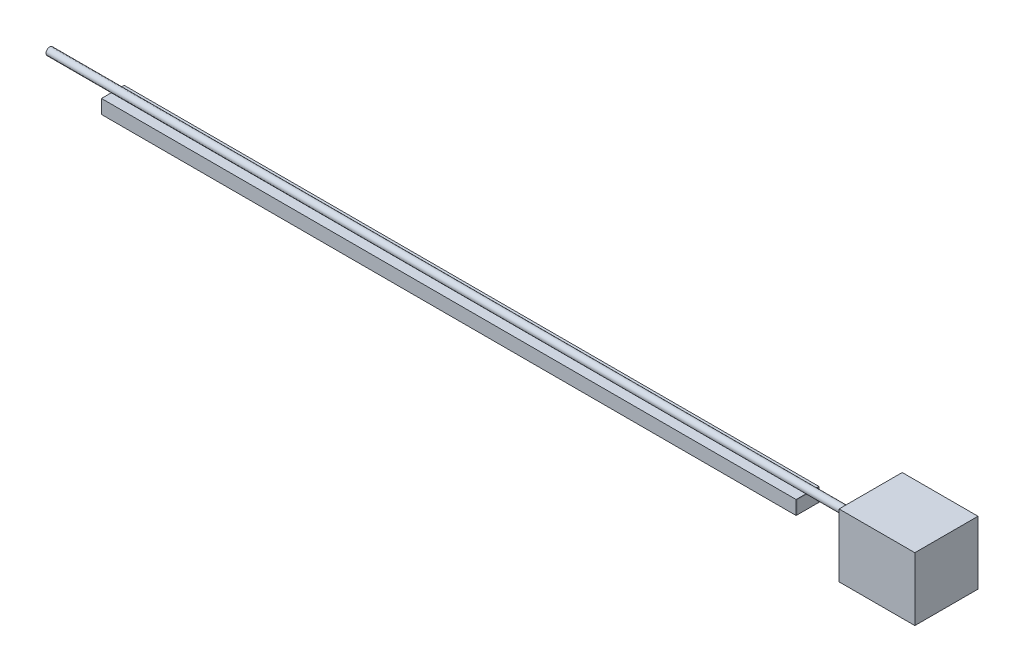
ISO-10303-21;
HEADER;
FILE_DESCRIPTION(('STEP AP214'),'2;1');
FILE_NAME('part.step','',(''),(''),'','','');
FILE_SCHEMA(('AUTOMOTIVE_DESIGN { 1 0 10303 214 1 1 1 1 }'));
ENDSEC;
DATA;
#1=APPLICATION_CONTEXT('core data for automotive mechanical design processes');
#2=APPLICATION_PROTOCOL_DEFINITION('international standard','automotive_design',2000,#1);
#3=PRODUCT_CONTEXT('',#1,'mechanical');
#4=PRODUCT('Part','Part','',(#3));
#5=PRODUCT_RELATED_PRODUCT_CATEGORY('part','',(#4));
#6=PRODUCT_DEFINITION_FORMATION('','',#4);
#7=PRODUCT_DEFINITION_CONTEXT('part definition',#1,'design');
#8=PRODUCT_DEFINITION('design','',#6,#7);
#9=PRODUCT_DEFINITION_SHAPE('','',#8);
#10=(LENGTH_UNIT() NAMED_UNIT(*) SI_UNIT(.MILLI.,.METRE.));
#11=(NAMED_UNIT(*) PLANE_ANGLE_UNIT() SI_UNIT($,.RADIAN.));
#12=(NAMED_UNIT(*) SI_UNIT($,.STERADIAN.) SOLID_ANGLE_UNIT());
#13=UNCERTAINTY_MEASURE_WITH_UNIT(LENGTH_MEASURE(1.E-05),#10,'distance_accuracy_value','');
#14=(GEOMETRIC_REPRESENTATION_CONTEXT(3) GLOBAL_UNCERTAINTY_ASSIGNED_CONTEXT((#13)) GLOBAL_UNIT_ASSIGNED_CONTEXT((#10,
#11,#12)) REPRESENTATION_CONTEXT('',''));
#15=CARTESIAN_POINT('',(0.,0.,0.));
#16=DIRECTION('',(0.,0.,1.));
#17=DIRECTION('',(1.,0.,0.));
#18=AXIS2_PLACEMENT_3D('',#15,#16,#17);
#19=CARTESIAN_POINT('',(548.,-11.,17.));
#20=DIRECTION('',(0.,-1.,0.));
#21=DIRECTION('',(0.,0.,-1.));
#22=AXIS2_PLACEMENT_3D('',#19,#20,#21);
#23=PLANE('',#22);
#24=DIRECTION('',(0.,0.,-1.));
#25=VECTOR('',#24,1.);
#26=CARTESIAN_POINT('',(550.,-11.,17.));
#27=LINE('',#26,#25);
#28=CARTESIAN_POINT('',(550.,-11.,17.));
#29=VERTEX_POINT('',#28);
#30=CARTESIAN_POINT('',(550.,-11.,-17.));
#31=VERTEX_POINT('',#30);
#32=EDGE_CURVE('P0_E81',#29,#31,#27,.T.);
#33=ORIENTED_EDGE('',*,*,#32,.F.);
#34=DIRECTION('',(1.,0.,0.));
#35=VECTOR('',#34,1.);
#36=CARTESIAN_POINT('',(548.,-11.,17.));
#37=LINE('',#36,#35);
#38=CARTESIAN_POINT('',(548.,-11.,17.));
#39=VERTEX_POINT('',#38);
#40=EDGE_CURVE('P0_E11',#39,#29,#37,.T.);
#41=ORIENTED_EDGE('',*,*,#40,.F.);
#42=DIRECTION('',(0.,0.,-1.));
#43=VECTOR('',#42,1.);
#44=CARTESIAN_POINT('',(548.,-11.,17.));
#45=LINE('',#44,#43);
#46=CARTESIAN_POINT('',(548.,-11.,-17.));
#47=VERTEX_POINT('',#46);
#48=EDGE_CURVE('P0_E75',#39,#47,#45,.T.);
#49=ORIENTED_EDGE('',*,*,#48,.T.);
#50=DIRECTION('',(1.,0.,0.));
#51=VECTOR('',#50,1.);
#52=CARTESIAN_POINT('',(548.,-11.,-17.));
#53=LINE('',#52,#51);
#54=EDGE_CURVE('P0_E20',#47,#31,#53,.T.);
#55=ORIENTED_EDGE('',*,*,#54,.T.);
#56=EDGE_LOOP('',(#33,#41,#49,#55));
#57=FACE_BOUND('',#56,.T.);
#58=ADVANCED_FACE('P0_F17',(#57),#23,.T.);
#59=CARTESIAN_POINT('',(548.,-11.,17.));
#60=DIRECTION('',(0.,0.,1.));
#61=DIRECTION('',(1.,0.,0.));
#62=AXIS2_PLACEMENT_3D('',#59,#60,#61);
#63=PLANE('',#62);
#64=DIRECTION('',(0.,-1.,0.));
#65=VECTOR('',#64,1.);
#66=CARTESIAN_POINT('',(550.,-11.,17.));
#67=LINE('',#66,#65);
#68=CARTESIAN_POINT('',(550.,10.,17.));
#69=VERTEX_POINT('',#68);
#70=EDGE_CURVE('P0_E77',#69,#29,#67,.T.);
#71=ORIENTED_EDGE('',*,*,#70,.F.);
#72=DIRECTION('',(1.,0.,0.));
#73=VECTOR('',#72,1.);
#74=CARTESIAN_POINT('',(548.,10.,17.));
#75=LINE('',#74,#73);
#76=CARTESIAN_POINT('',(548.,10.,17.));
#77=VERTEX_POINT('',#76);
#78=EDGE_CURVE('P0_E26',#77,#69,#75,.T.);
#79=ORIENTED_EDGE('',*,*,#78,.F.);
#80=DIRECTION('',(0.,-1.,0.));
#81=VECTOR('',#80,1.);
#82=CARTESIAN_POINT('',(548.,-11.,17.));
#83=LINE('',#82,#81);
#84=EDGE_CURVE('P0_E72',#77,#39,#83,.T.);
#85=ORIENTED_EDGE('',*,*,#84,.T.);
#86=ORIENTED_EDGE('',*,*,#40,.T.);
#87=EDGE_LOOP('',(#71,#79,#85,#86));
#88=FACE_BOUND('',#87,.T.);
#89=ADVANCED_FACE('P0_F91',(#88),#63,.T.);
#90=CARTESIAN_POINT('',(548.,10.,17.));
#91=DIRECTION('',(0.,1.,0.));
#92=DIRECTION('',(0.,0.,1.));
#93=AXIS2_PLACEMENT_3D('',#90,#91,#92);
#94=PLANE('',#93);
#95=DIRECTION('',(0.,0.,1.));
#96=VECTOR('',#95,1.);
#97=CARTESIAN_POINT('',(550.,10.,17.));
#98=LINE('',#97,#96);
#99=CARTESIAN_POINT('',(550.,10.,-17.));
#100=VERTEX_POINT('',#99);
#101=EDGE_CURVE('P0_E67',#100,#69,#98,.T.);
#102=ORIENTED_EDGE('',*,*,#101,.F.);
#103=DIRECTION('',(1.,0.,0.));
#104=VECTOR('',#103,1.);
#105=CARTESIAN_POINT('',(548.,10.,-17.));
#106=LINE('',#105,#104);
#107=CARTESIAN_POINT('',(548.,10.,-17.));
#108=VERTEX_POINT('',#107);
#109=EDGE_CURVE('P0_E62',#108,#100,#106,.T.);
#110=ORIENTED_EDGE('',*,*,#109,.F.);
#111=DIRECTION('',(0.,0.,1.));
#112=VECTOR('',#111,1.);
#113=CARTESIAN_POINT('',(548.,10.,17.));
#114=LINE('',#113,#112);
#115=EDGE_CURVE('P0_E65',#108,#77,#114,.T.);
#116=ORIENTED_EDGE('',*,*,#115,.T.);
#117=ORIENTED_EDGE('',*,*,#78,.T.);
#118=EDGE_LOOP('',(#102,#110,#116,#117));
#119=FACE_BOUND('',#118,.T.);
#120=ADVANCED_FACE('P0_F64',(#119),#94,.T.);
#121=CARTESIAN_POINT('',(548.,10.,-17.));
#122=DIRECTION('',(0.,0.,-1.));
#123=DIRECTION('',(-1.,0.,0.));
#124=AXIS2_PLACEMENT_3D('',#121,#122,#123);
#125=PLANE('',#124);
#126=DIRECTION('',(0.,1.,0.));
#127=VECTOR('',#126,1.);
#128=CARTESIAN_POINT('',(550.,10.,-17.));
#129=LINE('',#128,#127);
#130=EDGE_CURVE('P0_E84',#31,#100,#129,.T.);
#131=ORIENTED_EDGE('',*,*,#130,.F.);
#132=ORIENTED_EDGE('',*,*,#54,.F.);
#133=DIRECTION('',(0.,1.,0.));
#134=VECTOR('',#133,1.);
#135=CARTESIAN_POINT('',(548.,10.,-17.));
#136=LINE('',#135,#134);
#137=EDGE_CURVE('P0_E71',#47,#108,#136,.T.);
#138=ORIENTED_EDGE('',*,*,#137,.T.);
#139=ORIENTED_EDGE('',*,*,#109,.T.);
#140=EDGE_LOOP('',(#131,#132,#138,#139));
#141=FACE_BOUND('',#140,.T.);
#142=ADVANCED_FACE('P0_F74',(#141),#125,.T.);
#143=CARTESIAN_POINT('',(548.,0.,0.));
#144=DIRECTION('',(-1.,0.,0.));
#145=DIRECTION('',(0.,0.,1.));
#146=AXIS2_PLACEMENT_3D('',#143,#144,#145);
#147=PLANE('',#146);
#148=ORIENTED_EDGE('',*,*,#48,.F.);
#149=ORIENTED_EDGE('',*,*,#84,.F.);
#150=ORIENTED_EDGE('',*,*,#115,.F.);
#151=ORIENTED_EDGE('',*,*,#137,.F.);
#152=EDGE_LOOP('',(#148,#149,#150,#151));
#153=FACE_BOUND('',#152,.T.);
#154=ADVANCED_FACE('P0_F70',(#153),#147,.T.);
#155=CARTESIAN_POINT('',(550.,0.,0.));
#156=DIRECTION('',(-1.,0.,0.));
#157=DIRECTION('',(0.,0.,1.));
#158=AXIS2_PLACEMENT_3D('',#155,#156,#157);
#159=PLANE('',#158);
#160=ORIENTED_EDGE('',*,*,#32,.T.);
#161=ORIENTED_EDGE('',*,*,#130,.T.);
#162=ORIENTED_EDGE('',*,*,#101,.T.);
#163=ORIENTED_EDGE('',*,*,#70,.T.);
#164=EDGE_LOOP('',(#160,#161,#162,#163));
#165=FACE_BOUND('',#164,.T.);
#166=ADVANCED_FACE('P0_F90',(#165),#159,.F.);
#167=CLOSED_SHELL('',(#58,#89,#120,#142,#154,#166));
#168=MANIFOLD_SOLID_BREP('P0_B1',#167);
#169=CARTESIAN_POINT('',(650.,16.85,0.));
#170=DIRECTION('',(-1.,0.,0.));
#171=DIRECTION('',(0.,0.,1.));
#172=AXIS2_PLACEMENT_3D('',#169,#170,#171);
#173=CYLINDRICAL_SURFACE('',#172,5.85);
#174=CARTESIAN_POINT('',(-650.,16.85,0.));
#175=DIRECTION('',(1.,0.,0.));
#176=DIRECTION('',(0.,0.,-1.));
#177=AXIS2_PLACEMENT_3D('',#174,#175,#176);
#178=CIRCLE('',#177,5.85);
#179=CARTESIAN_POINT('',(-650.,16.85,-5.85000000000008));
#180=VERTEX_POINT('',#179);
#181=EDGE_CURVE('P1_E10',#180,#180,#178,.T.);
#182=ORIENTED_EDGE('',*,*,#181,.T.);
#183=EDGE_LOOP('',(#182));
#184=FACE_BOUND('',#183,.T.);
#185=CARTESIAN_POINT('',(750.,16.85,0.));
#186=DIRECTION('',(1.,0.,0.));
#187=DIRECTION('',(0.,0.,-1.));
#188=AXIS2_PLACEMENT_3D('',#185,#186,#187);
#189=CIRCLE('',#188,5.85);
#190=CARTESIAN_POINT('',(750.,16.85,-5.84999999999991));
#191=VERTEX_POINT('',#190);
#192=EDGE_CURVE('P1_E21',#191,#191,#189,.T.);
#193=ORIENTED_EDGE('',*,*,#192,.F.);
#194=EDGE_LOOP('',(#193));
#195=FACE_BOUND('',#194,.T.);
#196=ADVANCED_FACE('P1_F15',(#184,#195),#173,.T.);
#197=CARTESIAN_POINT('',(-650.,16.85,0.));
#198=DIRECTION('',(1.,0.,0.));
#199=DIRECTION('',(0.,0.,-1.));
#200=AXIS2_PLACEMENT_3D('',#197,#198,#199);
#201=PLANE('',#200);
#202=ORIENTED_EDGE('',*,*,#181,.F.);
#203=EDGE_LOOP('',(#202));
#204=FACE_BOUND('',#203,.T.);
#205=ADVANCED_FACE('P1_F30',(#204),#201,.F.);
#206=CARTESIAN_POINT('',(750.,16.85,0.));
#207=DIRECTION('',(1.,0.,0.));
#208=DIRECTION('',(0.,0.,-1.));
#209=AXIS2_PLACEMENT_3D('',#206,#207,#208);
#210=PLANE('',#209);
#211=ORIENTED_EDGE('',*,*,#192,.T.);
#212=EDGE_LOOP('',(#211));
#213=FACE_BOUND('',#212,.T.);
#214=ADVANCED_FACE('P1_F27',(#213),#210,.T.);
#215=CLOSED_SHELL('',(#196,#205,#214));
#216=MANIFOLD_SOLID_BREP('P1_B1',#215);
#217=CARTESIAN_POINT('',(549.,-11.,17.));
#218=CARTESIAN_POINT('',(549.,-12.8039677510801,4.93992907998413));
#219=CARTESIAN_POINT('',(549.,-11.8868294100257,-5.59201097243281));
#220=CARTESIAN_POINT('',(549.,-11.,-17.));
#221=B_SPLINE_CURVE_WITH_KNOTS('',3,(#217,#218,#219,#220),.UNSPECIFIED.,.F.,.F.,(4,4),(0.,1.),.UNSPECIFIED.);
#222=DIRECTION('',(-1.,0.,0.));
#223=VECTOR('',#222,1.);
#224=SURFACE_OF_LINEAR_EXTRUSION('',#221,#223);
#225=CARTESIAN_POINT('',(-549.,-11.,17.));
#226=CARTESIAN_POINT('',(-549.,-12.8039677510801,4.93992907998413));
#227=CARTESIAN_POINT('',(-549.,-11.8868294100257,-5.59201097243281));
#228=CARTESIAN_POINT('',(-549.,-11.,-17.));
#229=B_SPLINE_CURVE_WITH_KNOTS('',3,(#225,#226,#227,#228),.UNSPECIFIED.,.F.,.F.,(4,4),(0.,1.),.UNSPECIFIED.);
#230=CARTESIAN_POINT('',(-549.,-11.,17.));
#231=VERTEX_POINT('',#230);
#232=CARTESIAN_POINT('',(-549.,-11.,-17.));
#233=VERTEX_POINT('',#232);
#234=EDGE_CURVE('P2_E114',#231,#233,#229,.T.);
#235=ORIENTED_EDGE('',*,*,#234,.T.);
#236=DIRECTION('',(-1.,0.,0.));
#237=VECTOR('',#236,1.);
#238=CARTESIAN_POINT('',(549.,-11.,-17.));
#239=LINE('',#238,#237);
#240=CARTESIAN_POINT('',(549.,-11.,-17.));
#241=VERTEX_POINT('',#240);
#242=EDGE_CURVE('P2_E11',#241,#233,#239,.T.);
#243=ORIENTED_EDGE('',*,*,#242,.F.);
#244=CARTESIAN_POINT('',(549.,-11.,17.));
#245=VERTEX_POINT('',#244);
#246=EDGE_CURVE('P2_E138',#245,#241,#221,.T.);
#247=ORIENTED_EDGE('',*,*,#246,.F.);
#248=DIRECTION('',(-1.,0.,0.));
#249=VECTOR('',#248,1.);
#250=CARTESIAN_POINT('',(549.,-11.,17.));
#251=LINE('',#250,#249);
#252=EDGE_CURVE('P2_E110',#245,#231,#251,.T.);
#253=ORIENTED_EDGE('',*,*,#252,.T.);
#254=EDGE_LOOP('',(#235,#243,#247,#253));
#255=FACE_BOUND('',#254,.T.);
#256=ADVANCED_FACE('P2_F17',(#255),#224,.F.);
#257=CARTESIAN_POINT('',(549.,-11.,-17.));
#258=DIRECTION('',(0.,0.,1.));
#259=DIRECTION('',(1.,0.,0.));
#260=AXIS2_PLACEMENT_3D('',#257,#258,#259);
#261=PLANE('',#260);
#262=DIRECTION('',(0.,1.,0.));
#263=VECTOR('',#262,1.);
#264=CARTESIAN_POINT('',(-549.,-11.,-17.));
#265=LINE('',#264,#263);
#266=CARTESIAN_POINT('',(-549.,-6.,-17.));
#267=VERTEX_POINT('',#266);
#268=EDGE_CURVE('P2_E119',#233,#267,#265,.T.);
#269=ORIENTED_EDGE('',*,*,#268,.T.);
#270=DIRECTION('',(-1.,0.,0.));
#271=VECTOR('',#270,1.);
#272=CARTESIAN_POINT('',(549.,-6.,-17.));
#273=LINE('',#272,#271);
#274=CARTESIAN_POINT('',(549.,-6.,-17.));
#275=VERTEX_POINT('',#274);
#276=EDGE_CURVE('P2_E26',#275,#267,#273,.T.);
#277=ORIENTED_EDGE('',*,*,#276,.F.);
#278=DIRECTION('',(0.,1.,0.));
#279=VECTOR('',#278,1.);
#280=CARTESIAN_POINT('',(549.,-11.,-17.));
#281=LINE('',#280,#279);
#282=EDGE_CURVE('P2_E77',#241,#275,#281,.T.);
#283=ORIENTED_EDGE('',*,*,#282,.F.);
#284=ORIENTED_EDGE('',*,*,#242,.T.);
#285=EDGE_LOOP('',(#269,#277,#283,#284));
#286=FACE_BOUND('',#285,.T.);
#287=ADVANCED_FACE('P2_F182',(#286),#261,.F.);
#288=CARTESIAN_POINT('',(549.,-6.,-16.));
#289=DIRECTION('',(0.,-1.,0.));
#290=DIRECTION('',(0.,0.,-1.));
#291=AXIS2_PLACEMENT_3D('',#288,#289,#290);
#292=PLANE('',#291);
#293=DIRECTION('',(0.,0.,1.));
#294=VECTOR('',#293,1.);
#295=CARTESIAN_POINT('',(-549.,-6.,-16.));
#296=LINE('',#295,#294);
#297=CARTESIAN_POINT('',(-549.,-6.,-16.));
#298=VERTEX_POINT('',#297);
#299=EDGE_CURVE('P2_E124',#267,#298,#296,.T.);
#300=ORIENTED_EDGE('',*,*,#299,.T.);
#301=DIRECTION('',(-1.,0.,0.));
#302=VECTOR('',#301,1.);
#303=CARTESIAN_POINT('',(549.,-6.,-16.));
#304=LINE('',#303,#302);
#305=CARTESIAN_POINT('',(549.,-6.,-16.));
#306=VERTEX_POINT('',#305);
#307=EDGE_CURVE('P2_E145',#306,#298,#304,.T.);
#308=ORIENTED_EDGE('',*,*,#307,.F.);
#309=DIRECTION('',(0.,0.,1.));
#310=VECTOR('',#309,1.);
#311=CARTESIAN_POINT('',(549.,-6.,-16.));
#312=LINE('',#311,#310);
#313=EDGE_CURVE('P2_E153',#275,#306,#312,.T.);
#314=ORIENTED_EDGE('',*,*,#313,.F.);
#315=ORIENTED_EDGE('',*,*,#276,.T.);
#316=EDGE_LOOP('',(#300,#308,#314,#315));
#317=FACE_BOUND('',#316,.T.);
#318=ADVANCED_FACE('P2_F151',(#317),#292,.F.);
#319=CARTESIAN_POINT('',(549.,-10.0748780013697,-16.));
#320=DIRECTION('',(0.,0.,-1.));
#321=DIRECTION('',(0.,1.,0.));
#322=AXIS2_PLACEMENT_3D('',#319,#320,#321);
#323=PLANE('',#322);
#324=DIRECTION('',(0.,-1.,0.));
#325=VECTOR('',#324,1.);
#326=CARTESIAN_POINT('',(-549.,-10.0748780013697,-16.));
#327=LINE('',#326,#325);
#328=CARTESIAN_POINT('',(-549.,-10.0748780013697,-16.));
#329=VERTEX_POINT('',#328);
#330=EDGE_CURVE('P2_E126',#298,#329,#327,.T.);
#331=ORIENTED_EDGE('',*,*,#330,.T.);
#332=DIRECTION('',(-1.,0.,0.));
#333=VECTOR('',#332,1.);
#334=CARTESIAN_POINT('',(549.,-10.0748780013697,-16.));
#335=LINE('',#334,#333);
#336=CARTESIAN_POINT('',(549.,-10.0748780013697,-16.));
#337=VERTEX_POINT('',#336);
#338=EDGE_CURVE('P2_E142',#337,#329,#335,.T.);
#339=ORIENTED_EDGE('',*,*,#338,.F.);
#340=DIRECTION('',(0.,-1.,0.));
#341=VECTOR('',#340,1.);
#342=CARTESIAN_POINT('',(549.,-10.0748780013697,-16.));
#343=LINE('',#342,#341);
#344=EDGE_CURVE('P2_E165',#306,#337,#343,.T.);
#345=ORIENTED_EDGE('',*,*,#344,.F.);
#346=ORIENTED_EDGE('',*,*,#307,.T.);
#347=EDGE_LOOP('',(#331,#339,#345,#346));
#348=FACE_BOUND('',#347,.T.);
#349=ADVANCED_FACE('P2_F161',(#348),#323,.F.);
#350=CARTESIAN_POINT('',(549.,-10.0748780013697,-16.));
#351=CARTESIAN_POINT('',(549.,-10.1791678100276,-14.6632383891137));
#352=CARTESIAN_POINT('',(549.,-10.3893876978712,-11.9755906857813));
#353=CARTESIAN_POINT('',(549.,-10.7642021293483,-6.71077190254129));
#354=CARTESIAN_POINT('',(549.,-11.0216241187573,-1.49019693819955));
#355=CARTESIAN_POINT('',(549.,-11.0520527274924,3.76870554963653));
#356=CARTESIAN_POINT('',(549.,-10.934802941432,7.75866460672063));
#357=CARTESIAN_POINT('',(549.,-10.6973581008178,11.1455915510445));
#358=CARTESIAN_POINT('',(549.,-10.4110622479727,13.8975776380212));
#359=CARTESIAN_POINT('',(549.,-10.2317243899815,15.3027193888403));
#360=CARTESIAN_POINT('',(549.,-10.1342698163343,16.));
#361=B_SPLINE_CURVE_WITH_KNOTS('',3,(#350,#351,#352,#353,#354,#355,#356,#357,#358,#359,#360),
.UNSPECIFIED.,.F.,.F.,(4,1,1,1,1,1,1,1,4),(0.0238849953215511,0.14252422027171,
0.261163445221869,0.498441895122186,0.617081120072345,0.735720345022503,0.854359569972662,
0.913679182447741,0.972998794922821),.UNSPECIFIED.);
#362=DIRECTION('',(-1.,0.,0.));
#363=VECTOR('',#362,1.);
#364=SURFACE_OF_LINEAR_EXTRUSION('',#361,#363);
#365=CARTESIAN_POINT('',(-549.,-10.0748780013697,-16.));
#366=CARTESIAN_POINT('',(-549.,-10.1791678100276,-14.6632383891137));
#367=CARTESIAN_POINT('',(-549.,-10.3893876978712,-11.9755906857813));
#368=CARTESIAN_POINT('',(-549.,-10.7642021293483,-6.71077190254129));
#369=CARTESIAN_POINT('',(-549.,-11.0216241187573,-1.49019693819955));
#370=CARTESIAN_POINT('',(-549.,-11.0520527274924,3.76870554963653));
#371=CARTESIAN_POINT('',(-549.,-10.934802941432,7.75866460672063));
#372=CARTESIAN_POINT('',(-549.,-10.6973581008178,11.1455915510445));
#373=CARTESIAN_POINT('',(-549.,-10.4110622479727,13.8975776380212));
#374=CARTESIAN_POINT('',(-549.,-10.2317243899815,15.3027193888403));
#375=CARTESIAN_POINT('',(-549.,-10.1342698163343,16.));
#376=B_SPLINE_CURVE_WITH_KNOTS('',3,(#365,#366,#367,#368,#369,#370,#371,#372,#373,#374,#375),
.UNSPECIFIED.,.F.,.F.,(4,1,1,1,1,1,1,1,4),(0.0238849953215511,0.14252422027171,
0.261163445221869,0.498441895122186,0.617081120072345,0.735720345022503,0.854359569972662,
0.913679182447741,0.972998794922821),.UNSPECIFIED.);
#377=CARTESIAN_POINT('',(-549.,-10.1342698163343,16.));
#378=VERTEX_POINT('',#377);
#379=EDGE_CURVE('P2_E128',#329,#378,#376,.T.);
#380=ORIENTED_EDGE('',*,*,#379,.T.);
#381=DIRECTION('',(-1.,0.,0.));
#382=VECTOR('',#381,1.);
#383=CARTESIAN_POINT('',(549.,-10.1342698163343,16.));
#384=LINE('',#383,#382);
#385=CARTESIAN_POINT('',(549.,-10.1342698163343,16.));
#386=VERTEX_POINT('',#385);
#387=EDGE_CURVE('P2_E105',#386,#378,#384,.T.);
#388=ORIENTED_EDGE('',*,*,#387,.F.);
#389=EDGE_CURVE('P2_E96',#337,#386,#361,.T.);
#390=ORIENTED_EDGE('',*,*,#389,.F.);
#391=ORIENTED_EDGE('',*,*,#338,.T.);
#392=EDGE_LOOP('',(#380,#388,#390,#391));
#393=FACE_BOUND('',#392,.T.);
#394=ADVANCED_FACE('P2_F164',(#393),#364,.F.);
#395=CARTESIAN_POINT('',(549.,-10.1342698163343,16.));
#396=DIRECTION('',(0.,0.,1.));
#397=DIRECTION('',(1.,0.,0.));
#398=AXIS2_PLACEMENT_3D('',#395,#396,#397);
#399=PLANE('',#398);
#400=DIRECTION('',(0.,1.,0.));
#401=VECTOR('',#400,1.);
#402=CARTESIAN_POINT('',(-549.,-10.1342698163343,16.));
#403=LINE('',#402,#401);
#404=CARTESIAN_POINT('',(-549.,-6.,16.));
#405=VERTEX_POINT('',#404);
#406=EDGE_CURVE('P2_E104',#378,#405,#403,.T.);
#407=ORIENTED_EDGE('',*,*,#406,.T.);
#408=DIRECTION('',(-1.,0.,0.));
#409=VECTOR('',#408,1.);
#410=CARTESIAN_POINT('',(549.,-6.,16.));
#411=LINE('',#410,#409);
#412=CARTESIAN_POINT('',(549.,-6.,16.));
#413=VERTEX_POINT('',#412);
#414=EDGE_CURVE('P2_E101',#413,#405,#411,.T.);
#415=ORIENTED_EDGE('',*,*,#414,.F.);
#416=DIRECTION('',(0.,1.,0.));
#417=VECTOR('',#416,1.);
#418=CARTESIAN_POINT('',(549.,-10.1342698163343,16.));
#419=LINE('',#418,#417);
#420=EDGE_CURVE('P2_E90',#386,#413,#419,.T.);
#421=ORIENTED_EDGE('',*,*,#420,.F.);
#422=ORIENTED_EDGE('',*,*,#387,.T.);
#423=EDGE_LOOP('',(#407,#415,#421,#422));
#424=FACE_BOUND('',#423,.T.);
#425=ADVANCED_FACE('P2_F102',(#424),#399,.F.);
#426=CARTESIAN_POINT('',(549.,-6.,17.));
#427=DIRECTION('',(0.,-1.,0.));
#428=DIRECTION('',(0.,0.,-1.));
#429=AXIS2_PLACEMENT_3D('',#426,#427,#428);
#430=PLANE('',#429);
#431=DIRECTION('',(0.,0.,1.));
#432=VECTOR('',#431,1.);
#433=CARTESIAN_POINT('',(-549.,-6.,17.));
#434=LINE('',#433,#432);
#435=CARTESIAN_POINT('',(-549.,-6.,17.));
#436=VERTEX_POINT('',#435);
#437=EDGE_CURVE('P2_E63',#405,#436,#434,.T.);
#438=ORIENTED_EDGE('',*,*,#437,.T.);
#439=DIRECTION('',(-1.,0.,0.));
#440=VECTOR('',#439,1.);
#441=CARTESIAN_POINT('',(549.,-6.,17.));
#442=LINE('',#441,#440);
#443=CARTESIAN_POINT('',(549.,-6.,17.));
#444=VERTEX_POINT('',#443);
#445=EDGE_CURVE('P2_E106',#444,#436,#442,.T.);
#446=ORIENTED_EDGE('',*,*,#445,.F.);
#447=DIRECTION('',(0.,0.,1.));
#448=VECTOR('',#447,1.);
#449=CARTESIAN_POINT('',(549.,-6.,17.));
#450=LINE('',#449,#448);
#451=EDGE_CURVE('P2_E94',#413,#444,#450,.T.);
#452=ORIENTED_EDGE('',*,*,#451,.F.);
#453=ORIENTED_EDGE('',*,*,#414,.T.);
#454=EDGE_LOOP('',(#438,#446,#452,#453));
#455=FACE_BOUND('',#454,.T.);
#456=ADVANCED_FACE('P2_F108',(#455),#430,.F.);
#457=CARTESIAN_POINT('',(549.,-11.,17.));
#458=DIRECTION('',(0.,0.,-1.));
#459=DIRECTION('',(-1.,0.,0.));
#460=AXIS2_PLACEMENT_3D('',#457,#458,#459);
#461=PLANE('',#460);
#462=DIRECTION('',(0.,-1.,0.));
#463=VECTOR('',#462,1.);
#464=CARTESIAN_POINT('',(-549.,-11.,17.));
#465=LINE('',#464,#463);
#466=EDGE_CURVE('P2_E69',#436,#231,#465,.T.);
#467=ORIENTED_EDGE('',*,*,#466,.T.);
#468=ORIENTED_EDGE('',*,*,#252,.F.);
#469=DIRECTION('',(0.,-1.,0.));
#470=VECTOR('',#469,1.);
#471=CARTESIAN_POINT('',(549.,-11.,17.));
#472=LINE('',#471,#470);
#473=EDGE_CURVE('P2_E34',#444,#245,#472,.T.);
#474=ORIENTED_EDGE('',*,*,#473,.F.);
#475=ORIENTED_EDGE('',*,*,#445,.T.);
#476=EDGE_LOOP('',(#467,#468,#474,#475));
#477=FACE_BOUND('',#476,.T.);
#478=ADVANCED_FACE('P2_F191',(#477),#461,.F.);
#479=CARTESIAN_POINT('',(549.,-12.0090489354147,-0.244530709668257));
#480=DIRECTION('',(-1.,0.,0.));
#481=DIRECTION('',(0.,0.,1.));
#482=AXIS2_PLACEMENT_3D('',#479,#480,#481);
#483=PLANE('',#482);
#484=ORIENTED_EDGE('',*,*,#246,.T.);
#485=ORIENTED_EDGE('',*,*,#282,.T.);
#486=ORIENTED_EDGE('',*,*,#313,.T.);
#487=ORIENTED_EDGE('',*,*,#344,.T.);
#488=ORIENTED_EDGE('',*,*,#389,.T.);
#489=ORIENTED_EDGE('',*,*,#420,.T.);
#490=ORIENTED_EDGE('',*,*,#451,.T.);
#491=ORIENTED_EDGE('',*,*,#473,.T.);
#492=EDGE_LOOP('',(#484,#485,#486,#487,#488,#489,#490,#491));
#493=FACE_BOUND('',#492,.T.);
#494=ADVANCED_FACE('P2_F92',(#493),#483,.F.);
#495=CARTESIAN_POINT('',(-549.,-12.0090489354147,-0.244530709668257));
#496=DIRECTION('',(-1.,0.,0.));
#497=DIRECTION('',(0.,0.,1.));
#498=AXIS2_PLACEMENT_3D('',#495,#496,#497);
#499=PLANE('',#498);
#500=ORIENTED_EDGE('',*,*,#234,.F.);
#501=ORIENTED_EDGE('',*,*,#466,.F.);
#502=ORIENTED_EDGE('',*,*,#437,.F.);
#503=ORIENTED_EDGE('',*,*,#406,.F.);
#504=ORIENTED_EDGE('',*,*,#379,.F.);
#505=ORIENTED_EDGE('',*,*,#330,.F.);
#506=ORIENTED_EDGE('',*,*,#299,.F.);
#507=ORIENTED_EDGE('',*,*,#268,.F.);
#508=EDGE_LOOP('',(#500,#501,#502,#503,#504,#505,#506,#507));
#509=FACE_BOUND('',#508,.T.);
#510=ADVANCED_FACE('P2_F157',(#509),#499,.T.);
#511=CLOSED_SHELL('',(#256,#287,#318,#349,#394,#425,#456,#478,#494,#510));
#512=MANIFOLD_SOLID_BREP('P2_B1',#511);
#513=CARTESIAN_POINT('',(770.,-35.9508298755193,-49.9999999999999));
#514=DIRECTION('',(0.,0.,1.));
#515=DIRECTION('',(0.,-1.,0.));
#516=AXIS2_PLACEMENT_3D('',#513,#514,#515);
#517=PLANE('',#516);
#518=DIRECTION('',(0.,1.,0.));
#519=VECTOR('',#518,1.);
#520=CARTESIAN_POINT('',(650.,-35.9508298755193,-50.));
#521=LINE('',#520,#519);
#522=CARTESIAN_POINT('',(650.,-35.9508298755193,-50.));
#523=VERTEX_POINT('',#522);
#524=CARTESIAN_POINT('',(650.,64.0491701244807,-50.));
#525=VERTEX_POINT('',#524);
#526=EDGE_CURVE('P3_E79',#523,#525,#521,.T.);
#527=ORIENTED_EDGE('',*,*,#526,.T.);
#528=DIRECTION('',(-1.,0.,0.));
#529=VECTOR('',#528,1.);
#530=CARTESIAN_POINT('',(770.,64.0491701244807,-49.9999999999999));
#531=LINE('',#530,#529);
#532=CARTESIAN_POINT('',(770.,64.0491701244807,-49.9999999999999));
#533=VERTEX_POINT('',#532);
#534=EDGE_CURVE('P3_E10',#533,#525,#531,.T.);
#535=ORIENTED_EDGE('',*,*,#534,.F.);
#536=DIRECTION('',(0.,1.,0.));
#537=VECTOR('',#536,1.);
#538=CARTESIAN_POINT('',(770.,-35.9508298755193,-49.9999999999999));
#539=LINE('',#538,#537);
#540=CARTESIAN_POINT('',(770.,-35.9508298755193,-49.9999999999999));
#541=VERTEX_POINT('',#540);
#542=EDGE_CURVE('P3_E67',#541,#533,#539,.T.);
#543=ORIENTED_EDGE('',*,*,#542,.F.);
#544=DIRECTION('',(-1.,0.,0.));
#545=VECTOR('',#544,1.);
#546=CARTESIAN_POINT('',(770.,-35.9508298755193,-49.9999999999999));
#547=LINE('',#546,#545);
#548=EDGE_CURVE('P3_E75',#541,#523,#547,.T.);
#549=ORIENTED_EDGE('',*,*,#548,.T.);
#550=EDGE_LOOP('',(#527,#535,#543,#549));
#551=FACE_BOUND('',#550,.T.);
#552=ADVANCED_FACE('P3_F16',(#551),#517,.F.);
#553=CARTESIAN_POINT('',(770.,64.0491701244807,50.0000000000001));
#554=DIRECTION('',(0.,-1.,0.));
#555=DIRECTION('',(0.,0.,-1.));
#556=AXIS2_PLACEMENT_3D('',#553,#554,#555);
#557=PLANE('',#556);
#558=DIRECTION('',(0.,0.,1.));
#559=VECTOR('',#558,1.);
#560=CARTESIAN_POINT('',(650.,64.0491701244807,50.0000000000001));
#561=LINE('',#560,#559);
#562=CARTESIAN_POINT('',(650.,64.0491701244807,50.0000000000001));
#563=VERTEX_POINT('',#562);
#564=EDGE_CURVE('P3_E71',#525,#563,#561,.T.);
#565=ORIENTED_EDGE('',*,*,#564,.T.);
#566=DIRECTION('',(-1.,0.,0.));
#567=VECTOR('',#566,1.);
#568=CARTESIAN_POINT('',(770.,64.0491701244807,50.0000000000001));
#569=LINE('',#568,#567);
#570=CARTESIAN_POINT('',(770.,64.0491701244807,50.0000000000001));
#571=VERTEX_POINT('',#570);
#572=EDGE_CURVE('P3_E24',#571,#563,#569,.T.);
#573=ORIENTED_EDGE('',*,*,#572,.F.);
#574=DIRECTION('',(0.,0.,1.));
#575=VECTOR('',#574,1.);
#576=CARTESIAN_POINT('',(770.,64.0491701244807,50.0000000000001));
#577=LINE('',#576,#575);
#578=EDGE_CURVE('P3_E62',#533,#571,#577,.T.);
#579=ORIENTED_EDGE('',*,*,#578,.F.);
#580=ORIENTED_EDGE('',*,*,#534,.T.);
#581=EDGE_LOOP('',(#565,#573,#579,#580));
#582=FACE_BOUND('',#581,.T.);
#583=ADVANCED_FACE('P3_F70',(#582),#557,.F.);
#584=CARTESIAN_POINT('',(770.,-35.9508298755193,50.0000000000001));
#585=DIRECTION('',(0.,0.,-1.));
#586=DIRECTION('',(0.,1.,0.));
#587=AXIS2_PLACEMENT_3D('',#584,#585,#586);
#588=PLANE('',#587);
#589=DIRECTION('',(0.,-1.,0.));
#590=VECTOR('',#589,1.);
#591=CARTESIAN_POINT('',(650.,-35.9508298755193,50.0000000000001));
#592=LINE('',#591,#590);
#593=CARTESIAN_POINT('',(650.,-35.9508298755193,50.0000000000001));
#594=VERTEX_POINT('',#593);
#595=EDGE_CURVE('P3_E49',#563,#594,#592,.T.);
#596=ORIENTED_EDGE('',*,*,#595,.T.);
#597=DIRECTION('',(-1.,0.,0.));
#598=VECTOR('',#597,1.);
#599=CARTESIAN_POINT('',(770.,-35.9508298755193,50.0000000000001));
#600=LINE('',#599,#598);
#601=CARTESIAN_POINT('',(770.,-35.9508298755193,50.0000000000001));
#602=VERTEX_POINT('',#601);
#603=EDGE_CURVE('P3_E72',#602,#594,#600,.T.);
#604=ORIENTED_EDGE('',*,*,#603,.F.);
#605=DIRECTION('',(0.,-1.,0.));
#606=VECTOR('',#605,1.);
#607=CARTESIAN_POINT('',(770.,-35.9508298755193,50.0000000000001));
#608=LINE('',#607,#606);
#609=EDGE_CURVE('P3_E65',#571,#602,#608,.T.);
#610=ORIENTED_EDGE('',*,*,#609,.F.);
#611=ORIENTED_EDGE('',*,*,#572,.T.);
#612=EDGE_LOOP('',(#596,#604,#610,#611));
#613=FACE_BOUND('',#612,.T.);
#614=ADVANCED_FACE('P3_F73',(#613),#588,.F.);
#615=CARTESIAN_POINT('',(770.,-35.9508298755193,50.0000000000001));
#616=DIRECTION('',(0.,1.,0.));
#617=DIRECTION('',(0.,0.,1.));
#618=AXIS2_PLACEMENT_3D('',#615,#616,#617);
#619=PLANE('',#618);
#620=DIRECTION('',(0.,0.,-1.));
#621=VECTOR('',#620,1.);
#622=CARTESIAN_POINT('',(650.,-35.9508298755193,50.0000000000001));
#623=LINE('',#622,#621);
#624=EDGE_CURVE('P3_E55',#594,#523,#623,.T.);
#625=ORIENTED_EDGE('',*,*,#624,.T.);
#626=ORIENTED_EDGE('',*,*,#548,.F.);
#627=DIRECTION('',(0.,0.,-1.));
#628=VECTOR('',#627,1.);
#629=CARTESIAN_POINT('',(770.,-35.9508298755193,50.0000000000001));
#630=LINE('',#629,#628);
#631=EDGE_CURVE('P3_E32',#602,#541,#630,.T.);
#632=ORIENTED_EDGE('',*,*,#631,.F.);
#633=ORIENTED_EDGE('',*,*,#603,.T.);
#634=EDGE_LOOP('',(#625,#626,#632,#633));
#635=FACE_BOUND('',#634,.T.);
#636=ADVANCED_FACE('P3_F87',(#635),#619,.F.);
#637=CARTESIAN_POINT('',(770.,16.85,0.));
#638=DIRECTION('',(-1.,0.,0.));
#639=DIRECTION('',(0.,1.,0.));
#640=AXIS2_PLACEMENT_3D('',#637,#638,#639);
#641=PLANE('',#640);
#642=ORIENTED_EDGE('',*,*,#542,.T.);
#643=ORIENTED_EDGE('',*,*,#578,.T.);
#644=ORIENTED_EDGE('',*,*,#609,.T.);
#645=ORIENTED_EDGE('',*,*,#631,.T.);
#646=EDGE_LOOP('',(#642,#643,#644,#645));
#647=FACE_BOUND('',#646,.T.);
#648=ADVANCED_FACE('P3_F63',(#647),#641,.F.);
#649=CARTESIAN_POINT('',(650.,16.85,0.));
#650=DIRECTION('',(-1.,0.,0.));
#651=DIRECTION('',(0.,1.,0.));
#652=AXIS2_PLACEMENT_3D('',#649,#650,#651);
#653=PLANE('',#652);
#654=CARTESIAN_POINT('',(650.,16.85,0.));
#655=DIRECTION('',(-1.,0.,0.));
#656=DIRECTION('',(0.,1.,0.));
#657=AXIS2_PLACEMENT_3D('',#654,#655,#656);
#658=CIRCLE('',#657,5.85);
#659=CARTESIAN_POINT('',(650.,22.7,0.));
#660=VERTEX_POINT('',#659);
#661=EDGE_CURVE('P3_E93',#660,#660,#658,.T.);
#662=ORIENTED_EDGE('',*,*,#661,.F.);
#663=EDGE_LOOP('',(#662));
#664=FACE_BOUND('',#663,.T.);
#665=ORIENTED_EDGE('',*,*,#526,.F.);
#666=ORIENTED_EDGE('',*,*,#624,.F.);
#667=ORIENTED_EDGE('',*,*,#595,.F.);
#668=ORIENTED_EDGE('',*,*,#564,.F.);
#669=EDGE_LOOP('',(#665,#666,#667,#668));
#670=FACE_BOUND('',#669,.T.);
#671=ADVANCED_FACE('P3_F90',(#664,#670),#653,.T.);
#672=CARTESIAN_POINT('',(750.,16.85,0.));
#673=DIRECTION('',(-1.,0.,0.));
#674=DIRECTION('',(0.,1.,0.));
#675=AXIS2_PLACEMENT_3D('',#672,#673,#674);
#676=CYLINDRICAL_SURFACE('',#675,5.85);
#677=CARTESIAN_POINT('',(750.,16.85,0.));
#678=DIRECTION('',(-1.,0.,0.));
#679=DIRECTION('',(0.,1.,0.));
#680=AXIS2_PLACEMENT_3D('',#677,#678,#679);
#681=CIRCLE('',#680,5.85);
#682=CARTESIAN_POINT('',(750.,22.7,0.));
#683=VERTEX_POINT('',#682);
#684=EDGE_CURVE('P3_E82',#683,#683,#681,.T.);
#685=ORIENTED_EDGE('',*,*,#684,.F.);
#686=EDGE_LOOP('',(#685));
#687=FACE_BOUND('',#686,.T.);
#688=ORIENTED_EDGE('',*,*,#661,.T.);
#689=EDGE_LOOP('',(#688));
#690=FACE_BOUND('',#689,.T.);
#691=ADVANCED_FACE('P3_F101',(#687,#690),#676,.F.);
#692=CARTESIAN_POINT('',(750.,16.85,0.));
#693=DIRECTION('',(-1.,0.,0.));
#694=DIRECTION('',(0.,1.,0.));
#695=AXIS2_PLACEMENT_3D('',#692,#693,#694);
#696=PLANE('',#695);
#697=ORIENTED_EDGE('',*,*,#684,.T.);
#698=EDGE_LOOP('',(#697));
#699=FACE_BOUND('',#698,.T.);
#700=ADVANCED_FACE('P3_F99',(#699),#696,.T.);
#701=CLOSED_SHELL('',(#552,#583,#614,#636,#648,#671,#691,#700));
#702=MANIFOLD_SOLID_BREP('P3_B1',#701);
#703=CARTESIAN_POINT('',(550.,-11.,-18.));
#704=DIRECTION('',(0.,0.,1.));
#705=DIRECTION('',(1.,0.,0.));
#706=AXIS2_PLACEMENT_3D('',#703,#704,#705);
#707=PLANE('',#706);
#708=DIRECTION('',(0.,1.,0.));
#709=VECTOR('',#708,1.);
#710=CARTESIAN_POINT('',(-550.,-11.,-18.));
#711=LINE('',#710,#709);
#712=CARTESIAN_POINT('',(-550.,-11.,-18.));
#713=VERTEX_POINT('',#712);
#714=CARTESIAN_POINT('',(-550.,11.,-18.));
#715=VERTEX_POINT('',#714);
#716=EDGE_CURVE('P4_E113',#713,#715,#711,.T.);
#717=ORIENTED_EDGE('',*,*,#716,.T.);
#718=DIRECTION('',(-1.,0.,0.));
#719=VECTOR('',#718,1.);
#720=CARTESIAN_POINT('',(550.,11.,-18.));
#721=LINE('',#720,#719);
#722=CARTESIAN_POINT('',(550.,11.,-18.));
#723=VERTEX_POINT('',#722);
#724=EDGE_CURVE('P4_E11',#723,#715,#721,.T.);
#725=ORIENTED_EDGE('',*,*,#724,.F.);
#726=DIRECTION('',(0.,1.,0.));
#727=VECTOR('',#726,1.);
#728=CARTESIAN_POINT('',(550.,-11.,-18.));
#729=LINE('',#728,#727);
#730=CARTESIAN_POINT('',(550.,-11.,-18.));
#731=VERTEX_POINT('',#730);
#732=EDGE_CURVE('P4_E127',#731,#723,#729,.T.);
#733=ORIENTED_EDGE('',*,*,#732,.F.);
#734=DIRECTION('',(-1.,0.,0.));
#735=VECTOR('',#734,1.);
#736=CARTESIAN_POINT('',(550.,-11.,-18.));
#737=LINE('',#736,#735);
#738=EDGE_CURVE('P4_E109',#731,#713,#737,.T.);
#739=ORIENTED_EDGE('',*,*,#738,.T.);
#740=EDGE_LOOP('',(#717,#725,#733,#739));
#741=FACE_BOUND('',#740,.T.);
#742=ADVANCED_FACE('P4_F17',(#741),#707,.F.);
#743=CARTESIAN_POINT('',(550.,11.,18.));
#744=DIRECTION('',(0.,-1.,0.));
#745=DIRECTION('',(0.,0.,-1.));
#746=AXIS2_PLACEMENT_3D('',#743,#744,#745);
#747=PLANE('',#746);
#748=DIRECTION('',(0.,0.,1.));
#749=VECTOR('',#748,1.);
#750=CARTESIAN_POINT('',(-550.,11.,18.));
#751=LINE('',#750,#749);
#752=CARTESIAN_POINT('',(-550.,11.,18.));
#753=VERTEX_POINT('',#752);
#754=EDGE_CURVE('P4_E116',#715,#753,#751,.T.);
#755=ORIENTED_EDGE('',*,*,#754,.T.);
#756=DIRECTION('',(-1.,0.,0.));
#757=VECTOR('',#756,1.);
#758=CARTESIAN_POINT('',(550.,11.,18.));
#759=LINE('',#758,#757);
#760=CARTESIAN_POINT('',(550.,11.,18.));
#761=VERTEX_POINT('',#760);
#762=EDGE_CURVE('P4_E25',#761,#753,#759,.T.);
#763=ORIENTED_EDGE('',*,*,#762,.F.);
#764=DIRECTION('',(0.,0.,1.));
#765=VECTOR('',#764,1.);
#766=CARTESIAN_POINT('',(550.,11.,18.));
#767=LINE('',#766,#765);
#768=EDGE_CURVE('P4_E76',#723,#761,#767,.T.);
#769=ORIENTED_EDGE('',*,*,#768,.F.);
#770=ORIENTED_EDGE('',*,*,#724,.T.);
#771=EDGE_LOOP('',(#755,#763,#769,#770));
#772=FACE_BOUND('',#771,.T.);
#773=ADVANCED_FACE('P4_F162',(#772),#747,.F.);
#774=CARTESIAN_POINT('',(550.,-11.,18.));
#775=DIRECTION('',(0.,0.,-1.));
#776=DIRECTION('',(-1.,0.,0.));
#777=AXIS2_PLACEMENT_3D('',#774,#775,#776);
#778=PLANE('',#777);
#779=DIRECTION('',(0.,-1.,0.));
#780=VECTOR('',#779,1.);
#781=CARTESIAN_POINT('',(-550.,-11.,18.));
#782=LINE('',#781,#780);
#783=CARTESIAN_POINT('',(-550.,-11.,18.));
#784=VERTEX_POINT('',#783);
#785=EDGE_CURVE('P4_E118',#753,#784,#782,.T.);
#786=ORIENTED_EDGE('',*,*,#785,.T.);
#787=DIRECTION('',(-1.,0.,0.));
#788=VECTOR('',#787,1.);
#789=CARTESIAN_POINT('',(550.,-11.,18.));
#790=LINE('',#789,#788);
#791=CARTESIAN_POINT('',(550.,-11.,18.));
#792=VERTEX_POINT('',#791);
#793=EDGE_CURVE('P4_E134',#792,#784,#790,.T.);
#794=ORIENTED_EDGE('',*,*,#793,.F.);
#795=DIRECTION('',(0.,-1.,0.));
#796=VECTOR('',#795,1.);
#797=CARTESIAN_POINT('',(550.,-11.,18.));
#798=LINE('',#797,#796);
#799=EDGE_CURVE('P4_E142',#761,#792,#798,.T.);
#800=ORIENTED_EDGE('',*,*,#799,.F.);
#801=ORIENTED_EDGE('',*,*,#762,.T.);
#802=EDGE_LOOP('',(#786,#794,#800,#801));
#803=FACE_BOUND('',#802,.T.);
#804=ADVANCED_FACE('P4_F140',(#803),#778,.F.);
#805=CARTESIAN_POINT('',(550.,-11.,18.));
#806=DIRECTION('',(0.,1.,0.));
#807=DIRECTION('',(0.,0.,1.));
#808=AXIS2_PLACEMENT_3D('',#805,#806,#807);
#809=PLANE('',#808);
#810=DIRECTION('',(0.,0.,-1.));
#811=VECTOR('',#810,1.);
#812=CARTESIAN_POINT('',(-550.,-11.,18.));
#813=LINE('',#812,#811);
#814=CARTESIAN_POINT('',(-550.,-11.,17.));
#815=VERTEX_POINT('',#814);
#816=EDGE_CURVE('P4_E120',#784,#815,#813,.T.);
#817=ORIENTED_EDGE('',*,*,#816,.T.);
#818=DIRECTION('',(-1.,0.,0.));
#819=VECTOR('',#818,1.);
#820=CARTESIAN_POINT('',(550.,-11.,17.));
#821=LINE('',#820,#819);
#822=CARTESIAN_POINT('',(550.,-11.,17.));
#823=VERTEX_POINT('',#822);
#824=EDGE_CURVE('P4_E131',#823,#815,#821,.T.);
#825=ORIENTED_EDGE('',*,*,#824,.F.);
#826=DIRECTION('',(0.,0.,-1.));
#827=VECTOR('',#826,1.);
#828=CARTESIAN_POINT('',(550.,-11.,18.));
#829=LINE('',#828,#827);
#830=EDGE_CURVE('P4_E154',#792,#823,#829,.T.);
#831=ORIENTED_EDGE('',*,*,#830,.F.);
#832=ORIENTED_EDGE('',*,*,#793,.T.);
#833=EDGE_LOOP('',(#817,#825,#831,#832));
#834=FACE_BOUND('',#833,.T.);
#835=ADVANCED_FACE('P4_F150',(#834),#809,.F.);
#836=CARTESIAN_POINT('',(550.,-11.,17.));
#837=DIRECTION('',(0.,0.,1.));
#838=DIRECTION('',(1.,0.,0.));
#839=AXIS2_PLACEMENT_3D('',#836,#837,#838);
#840=PLANE('',#839);
#841=DIRECTION('',(0.,1.,0.));
#842=VECTOR('',#841,1.);
#843=CARTESIAN_POINT('',(-550.,-11.,17.));
#844=LINE('',#843,#842);
#845=CARTESIAN_POINT('',(-550.,10.,17.));
#846=VERTEX_POINT('',#845);
#847=EDGE_CURVE('P4_E122',#815,#846,#844,.T.);
#848=ORIENTED_EDGE('',*,*,#847,.T.);
#849=DIRECTION('',(-1.,0.,0.));
#850=VECTOR('',#849,1.);
#851=CARTESIAN_POINT('',(550.,10.,17.));
#852=LINE('',#851,#850);
#853=CARTESIAN_POINT('',(550.,10.,17.));
#854=VERTEX_POINT('',#853);
#855=EDGE_CURVE('P4_E104',#854,#846,#852,.T.);
#856=ORIENTED_EDGE('',*,*,#855,.F.);
#857=DIRECTION('',(0.,1.,0.));
#858=VECTOR('',#857,1.);
#859=CARTESIAN_POINT('',(550.,-11.,17.));
#860=LINE('',#859,#858);
#861=EDGE_CURVE('P4_E95',#823,#854,#860,.T.);
#862=ORIENTED_EDGE('',*,*,#861,.F.);
#863=ORIENTED_EDGE('',*,*,#824,.T.);
#864=EDGE_LOOP('',(#848,#856,#862,#863));
#865=FACE_BOUND('',#864,.T.);
#866=ADVANCED_FACE('P4_F153',(#865),#840,.F.);
#867=CARTESIAN_POINT('',(550.,10.,17.));
#868=DIRECTION('',(0.,1.,0.));
#869=DIRECTION('',(0.,0.,1.));
#870=AXIS2_PLACEMENT_3D('',#867,#868,#869);
#871=PLANE('',#870);
#872=DIRECTION('',(0.,0.,-1.));
#873=VECTOR('',#872,1.);
#874=CARTESIAN_POINT('',(-550.,10.,17.));
#875=LINE('',#874,#873);
#876=CARTESIAN_POINT('',(-550.,10.,-17.));
#877=VERTEX_POINT('',#876);
#878=EDGE_CURVE('P4_E103',#846,#877,#875,.T.);
#879=ORIENTED_EDGE('',*,*,#878,.T.);
#880=DIRECTION('',(-1.,0.,0.));
#881=VECTOR('',#880,1.);
#882=CARTESIAN_POINT('',(550.,10.,-17.));
#883=LINE('',#882,#881);
#884=CARTESIAN_POINT('',(550.,10.,-17.));
#885=VERTEX_POINT('',#884);
#886=EDGE_CURVE('P4_E100',#885,#877,#883,.T.);
#887=ORIENTED_EDGE('',*,*,#886,.F.);
#888=DIRECTION('',(0.,0.,-1.));
#889=VECTOR('',#888,1.);
#890=CARTESIAN_POINT('',(550.,10.,17.));
#891=LINE('',#890,#889);
#892=EDGE_CURVE('P4_E89',#854,#885,#891,.T.);
#893=ORIENTED_EDGE('',*,*,#892,.F.);
#894=ORIENTED_EDGE('',*,*,#855,.T.);
#895=EDGE_LOOP('',(#879,#887,#893,#894));
#896=FACE_BOUND('',#895,.T.);
#897=ADVANCED_FACE('P4_F101',(#896),#871,.F.);
#898=CARTESIAN_POINT('',(550.,-11.,-17.));
#899=DIRECTION('',(0.,0.,-1.));
#900=DIRECTION('',(-1.,0.,0.));
#901=AXIS2_PLACEMENT_3D('',#898,#899,#900);
#902=PLANE('',#901);
#903=DIRECTION('',(0.,-1.,0.));
#904=VECTOR('',#903,1.);
#905=CARTESIAN_POINT('',(-550.,-11.,-17.));
#906=LINE('',#905,#904);
#907=CARTESIAN_POINT('',(-550.,-11.,-17.));
#908=VERTEX_POINT('',#907);
#909=EDGE_CURVE('P4_E62',#877,#908,#906,.T.);
#910=ORIENTED_EDGE('',*,*,#909,.T.);
#911=DIRECTION('',(-1.,0.,0.));
#912=VECTOR('',#911,1.);
#913=CARTESIAN_POINT('',(550.,-11.,-17.));
#914=LINE('',#913,#912);
#915=CARTESIAN_POINT('',(550.,-11.,-17.));
#916=VERTEX_POINT('',#915);
#917=EDGE_CURVE('P4_E105',#916,#908,#914,.T.);
#918=ORIENTED_EDGE('',*,*,#917,.F.);
#919=DIRECTION('',(0.,-1.,0.));
#920=VECTOR('',#919,1.);
#921=CARTESIAN_POINT('',(550.,-11.,-17.));
#922=LINE('',#921,#920);
#923=EDGE_CURVE('P4_E93',#885,#916,#922,.T.);
#924=ORIENTED_EDGE('',*,*,#923,.F.);
#925=ORIENTED_EDGE('',*,*,#886,.T.);
#926=EDGE_LOOP('',(#910,#918,#924,#925));
#927=FACE_BOUND('',#926,.T.);
#928=ADVANCED_FACE('P4_F107',(#927),#902,.F.);
#929=CARTESIAN_POINT('',(550.,-11.,-17.));
#930=DIRECTION('',(0.,1.,0.));
#931=DIRECTION('',(0.,0.,1.));
#932=AXIS2_PLACEMENT_3D('',#929,#930,#931);
#933=PLANE('',#932);
#934=DIRECTION('',(0.,0.,-1.));
#935=VECTOR('',#934,1.);
#936=CARTESIAN_POINT('',(-550.,-11.,-17.));
#937=LINE('',#936,#935);
#938=EDGE_CURVE('P4_E68',#908,#713,#937,.T.);
#939=ORIENTED_EDGE('',*,*,#938,.T.);
#940=ORIENTED_EDGE('',*,*,#738,.F.);
#941=DIRECTION('',(0.,0.,-1.));
#942=VECTOR('',#941,1.);
#943=CARTESIAN_POINT('',(550.,-11.,-17.));
#944=LINE('',#943,#942);
#945=EDGE_CURVE('P4_E33',#916,#731,#944,.T.);
#946=ORIENTED_EDGE('',*,*,#945,.F.);
#947=ORIENTED_EDGE('',*,*,#917,.T.);
#948=EDGE_LOOP('',(#939,#940,#946,#947));
#949=FACE_BOUND('',#948,.T.);
#950=ADVANCED_FACE('P4_F179',(#949),#933,.F.);
#951=CARTESIAN_POINT('',(550.,0.,0.));
#952=DIRECTION('',(-1.,0.,0.));
#953=DIRECTION('',(0.,0.,1.));
#954=AXIS2_PLACEMENT_3D('',#951,#952,#953);
#955=PLANE('',#954);
#956=ORIENTED_EDGE('',*,*,#732,.T.);
#957=ORIENTED_EDGE('',*,*,#768,.T.);
#958=ORIENTED_EDGE('',*,*,#799,.T.);
#959=ORIENTED_EDGE('',*,*,#830,.T.);
#960=ORIENTED_EDGE('',*,*,#861,.T.);
#961=ORIENTED_EDGE('',*,*,#892,.T.);
#962=ORIENTED_EDGE('',*,*,#923,.T.);
#963=ORIENTED_EDGE('',*,*,#945,.T.);
#964=EDGE_LOOP('',(#956,#957,#958,#959,#960,#961,#962,#963));
#965=FACE_BOUND('',#964,.T.);
#966=ADVANCED_FACE('P4_F91',(#965),#955,.F.);
#967=CARTESIAN_POINT('',(-550.,0.,0.));
#968=DIRECTION('',(-1.,0.,0.));
#969=DIRECTION('',(0.,0.,1.));
#970=AXIS2_PLACEMENT_3D('',#967,#968,#969);
#971=PLANE('',#970);
#972=ORIENTED_EDGE('',*,*,#716,.F.);
#973=ORIENTED_EDGE('',*,*,#938,.F.);
#974=ORIENTED_EDGE('',*,*,#909,.F.);
#975=ORIENTED_EDGE('',*,*,#878,.F.);
#976=ORIENTED_EDGE('',*,*,#847,.F.);
#977=ORIENTED_EDGE('',*,*,#816,.F.);
#978=ORIENTED_EDGE('',*,*,#785,.F.);
#979=ORIENTED_EDGE('',*,*,#754,.F.);
#980=EDGE_LOOP('',(#972,#973,#974,#975,#976,#977,#978,#979));
#981=FACE_BOUND('',#980,.T.);
#982=ADVANCED_FACE('P4_F146',(#981),#971,.T.);
#983=CLOSED_SHELL('',(#742,#773,#804,#835,#866,#897,#928,#950,#966,#982));
#984=MANIFOLD_SOLID_BREP('P4_B1',#983);
#985=CARTESIAN_POINT('',(-548.,-11.,17.));
#986=DIRECTION('',(0.,-1.,0.));
#987=DIRECTION('',(0.,0.,-1.));
#988=AXIS2_PLACEMENT_3D('',#985,#986,#987);
#989=PLANE('',#988);
#990=DIRECTION('',(0.,0.,-1.));
#991=VECTOR('',#990,1.);
#992=CARTESIAN_POINT('',(-550.,-11.,17.));
#993=LINE('',#992,#991);
#994=CARTESIAN_POINT('',(-550.,-11.,17.));
#995=VERTEX_POINT('',#994);
#996=CARTESIAN_POINT('',(-550.,-11.,-17.));
#997=VERTEX_POINT('',#996);
#998=EDGE_CURVE('P5_E81',#995,#997,#993,.T.);
#999=ORIENTED_EDGE('',*,*,#998,.T.);
#1000=DIRECTION('',(-1.,0.,0.));
#1001=VECTOR('',#1000,1.);
#1002=CARTESIAN_POINT('',(-548.,-11.,-17.));
#1003=LINE('',#1002,#1001);
#1004=CARTESIAN_POINT('',(-548.,-11.,-17.));
#1005=VERTEX_POINT('',#1004);
#1006=EDGE_CURVE('P5_E20',#1005,#997,#1003,.T.);
#1007=ORIENTED_EDGE('',*,*,#1006,.F.);
#1008=DIRECTION('',(0.,0.,-1.));
#1009=VECTOR('',#1008,1.);
#1010=CARTESIAN_POINT('',(-548.,-11.,17.));
#1011=LINE('',#1010,#1009);
#1012=CARTESIAN_POINT('',(-548.,-11.,17.));
#1013=VERTEX_POINT('',#1012);
#1014=EDGE_CURVE('P5_E70',#1013,#1005,#1011,.T.);
#1015=ORIENTED_EDGE('',*,*,#1014,.F.);
#1016=DIRECTION('',(-1.,0.,0.));
#1017=VECTOR('',#1016,1.);
#1018=CARTESIAN_POINT('',(-548.,-11.,17.));
#1019=LINE('',#1018,#1017);
#1020=EDGE_CURVE('P5_E11',#1013,#995,#1019,.T.);
#1021=ORIENTED_EDGE('',*,*,#1020,.T.);
#1022=EDGE_LOOP('',(#999,#1007,#1015,#1021));
#1023=FACE_BOUND('',#1022,.T.);
#1024=ADVANCED_FACE('P5_F17',(#1023),#989,.T.);
#1025=CARTESIAN_POINT('',(-548.,-11.,17.));
#1026=DIRECTION('',(0.,0.,1.));
#1027=DIRECTION('',(-1.,0.,0.));
#1028=AXIS2_PLACEMENT_3D('',#1025,#1026,#1027);
#1029=PLANE('',#1028);
#1030=DIRECTION('',(0.,-1.,0.));
#1031=VECTOR('',#1030,1.);
#1032=CARTESIAN_POINT('',(-550.,-11.,17.));
#1033=LINE('',#1032,#1031);
#1034=CARTESIAN_POINT('',(-550.,10.,17.));
#1035=VERTEX_POINT('',#1034);
#1036=EDGE_CURVE('P5_E58',#1035,#995,#1033,.T.);
#1037=ORIENTED_EDGE('',*,*,#1036,.T.);
#1038=ORIENTED_EDGE('',*,*,#1020,.F.);
#1039=DIRECTION('',(0.,-1.,0.));
#1040=VECTOR('',#1039,1.);
#1041=CARTESIAN_POINT('',(-548.,-11.,17.));
#1042=LINE('',#1041,#1040);
#1043=CARTESIAN_POINT('',(-548.,10.,17.));
#1044=VERTEX_POINT('',#1043);
#1045=EDGE_CURVE('P5_E35',#1044,#1013,#1042,.T.);
#1046=ORIENTED_EDGE('',*,*,#1045,.F.);
#1047=DIRECTION('',(-1.,0.,0.));
#1048=VECTOR('',#1047,1.);
#1049=CARTESIAN_POINT('',(-548.,10.,17.));
#1050=LINE('',#1049,#1048);
#1051=EDGE_CURVE('P5_E26',#1044,#1035,#1050,.T.);
#1052=ORIENTED_EDGE('',*,*,#1051,.T.);
#1053=EDGE_LOOP('',(#1037,#1038,#1046,#1052));
#1054=FACE_BOUND('',#1053,.T.);
#1055=ADVANCED_FACE('P5_F87',(#1054),#1029,.T.);
#1056=CARTESIAN_POINT('',(-548.,10.,17.));
#1057=DIRECTION('',(0.,1.,0.));
#1058=DIRECTION('',(0.,0.,1.));
#1059=AXIS2_PLACEMENT_3D('',#1056,#1057,#1058);
#1060=PLANE('',#1059);
#1061=DIRECTION('',(0.,0.,1.));
#1062=VECTOR('',#1061,1.);
#1063=CARTESIAN_POINT('',(-550.,10.,17.));
#1064=LINE('',#1063,#1062);
#1065=CARTESIAN_POINT('',(-550.,10.,-17.));
#1066=VERTEX_POINT('',#1065);
#1067=EDGE_CURVE('P5_E52',#1066,#1035,#1064,.T.);
#1068=ORIENTED_EDGE('',*,*,#1067,.T.);
#1069=ORIENTED_EDGE('',*,*,#1051,.F.);
#1070=DIRECTION('',(0.,0.,1.));
#1071=VECTOR('',#1070,1.);
#1072=CARTESIAN_POINT('',(-548.,10.,17.));
#1073=LINE('',#1072,#1071);
#1074=CARTESIAN_POINT('',(-548.,10.,-17.));
#1075=VERTEX_POINT('',#1074);
#1076=EDGE_CURVE('P5_E68',#1075,#1044,#1073,.T.);
#1077=ORIENTED_EDGE('',*,*,#1076,.F.);
#1078=DIRECTION('',(-1.,0.,0.));
#1079=VECTOR('',#1078,1.);
#1080=CARTESIAN_POINT('',(-548.,10.,-17.));
#1081=LINE('',#1080,#1079);
#1082=EDGE_CURVE('P5_E73',#1075,#1066,#1081,.T.);
#1083=ORIENTED_EDGE('',*,*,#1082,.T.);
#1084=EDGE_LOOP('',(#1068,#1069,#1077,#1083));
#1085=FACE_BOUND('',#1084,.T.);
#1086=ADVANCED_FACE('P5_F76',(#1085),#1060,.T.);
#1087=CARTESIAN_POINT('',(-548.,10.,-17.));
#1088=DIRECTION('',(0.,0.,-1.));
#1089=DIRECTION('',(1.,0.,0.));
#1090=AXIS2_PLACEMENT_3D('',#1087,#1088,#1089);
#1091=PLANE('',#1090);
#1092=DIRECTION('',(0.,1.,0.));
#1093=VECTOR('',#1092,1.);
#1094=CARTESIAN_POINT('',(-550.,10.,-17.));
#1095=LINE('',#1094,#1093);
#1096=EDGE_CURVE('P5_E75',#997,#1066,#1095,.T.);
#1097=ORIENTED_EDGE('',*,*,#1096,.T.);
#1098=ORIENTED_EDGE('',*,*,#1082,.F.);
#1099=DIRECTION('',(0.,1.,0.));
#1100=VECTOR('',#1099,1.);
#1101=CARTESIAN_POINT('',(-548.,10.,-17.));
#1102=LINE('',#1101,#1100);
#1103=EDGE_CURVE('P5_E65',#1005,#1075,#1102,.T.);
#1104=ORIENTED_EDGE('',*,*,#1103,.F.);
#1105=ORIENTED_EDGE('',*,*,#1006,.T.);
#1106=EDGE_LOOP('',(#1097,#1098,#1104,#1105));
#1107=FACE_BOUND('',#1106,.T.);
#1108=ADVANCED_FACE('P5_F74',(#1107),#1091,.T.);
#1109=CARTESIAN_POINT('',(-548.,0.,0.));
#1110=DIRECTION('',(1.,0.,0.));
#1111=DIRECTION('',(0.,0.,1.));
#1112=AXIS2_PLACEMENT_3D('',#1109,#1110,#1111);
#1113=PLANE('',#1112);
#1114=ORIENTED_EDGE('',*,*,#1014,.T.);
#1115=ORIENTED_EDGE('',*,*,#1103,.T.);
#1116=ORIENTED_EDGE('',*,*,#1076,.T.);
#1117=ORIENTED_EDGE('',*,*,#1045,.T.);
#1118=EDGE_LOOP('',(#1114,#1115,#1116,#1117));
#1119=FACE_BOUND('',#1118,.T.);
#1120=ADVANCED_FACE('P5_F66',(#1119),#1113,.T.);
#1121=CARTESIAN_POINT('',(-550.,0.,0.));
#1122=DIRECTION('',(1.,0.,0.));
#1123=DIRECTION('',(0.,0.,1.));
#1124=AXIS2_PLACEMENT_3D('',#1121,#1122,#1123);
#1125=PLANE('',#1124);
#1126=ORIENTED_EDGE('',*,*,#998,.F.);
#1127=ORIENTED_EDGE('',*,*,#1036,.F.);
#1128=ORIENTED_EDGE('',*,*,#1067,.F.);
#1129=ORIENTED_EDGE('',*,*,#1096,.F.);
#1130=EDGE_LOOP('',(#1126,#1127,#1128,#1129));
#1131=FACE_BOUND('',#1130,.T.);
#1132=ADVANCED_FACE('P5_F90',(#1131),#1125,.F.);
#1133=CLOSED_SHELL('',(#1024,#1055,#1086,#1108,#1120,#1132));
#1134=MANIFOLD_SOLID_BREP('P5_B1',#1133);
#1135=ADVANCED_BREP_SHAPE_REPRESENTATION('',(#18,#168,#216,#512,#702,#984,#1134),#14);
#1136=SHAPE_DEFINITION_REPRESENTATION(#9,#1135);
ENDSEC;
END-ISO-10303-21;
